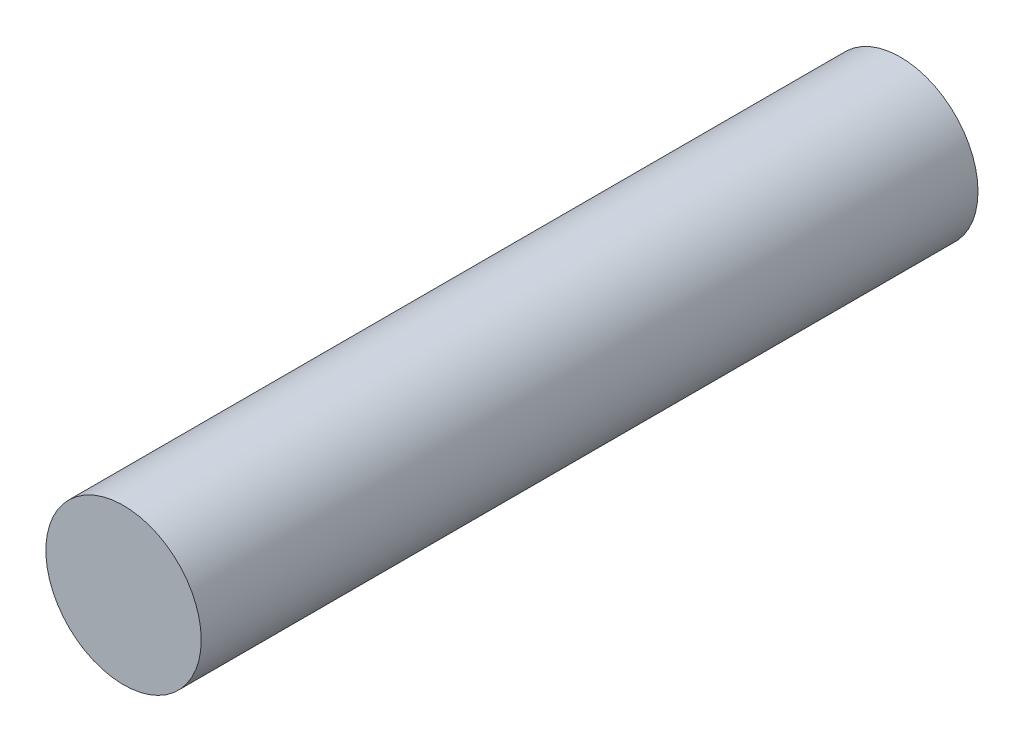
from build123d import *

# Parameters (mm, degrees)
SKIZZE1_W = 20
SKIZZE1_H = 2


with BuildPart() as part:
    # Skizze1 → Rotation1 (revolve)
    with BuildSketch(Plane(origin=(0, 0, 0), x_dir=(0, 0, -1), z_dir=(1, 0, 0)), mode=Mode.PRIVATE) as rotation1_sk:
        with Locations((10, 1)):
            Rectangle(SKIZZE1_W, SKIZZE1_H)
    revolve(rotation1_sk.sketch.rotate(Axis((0, 0, 0), (0, 0, -1)), 90), axis=Axis((0, 0, 0), (0, 0, -1)))


solid = part.part
